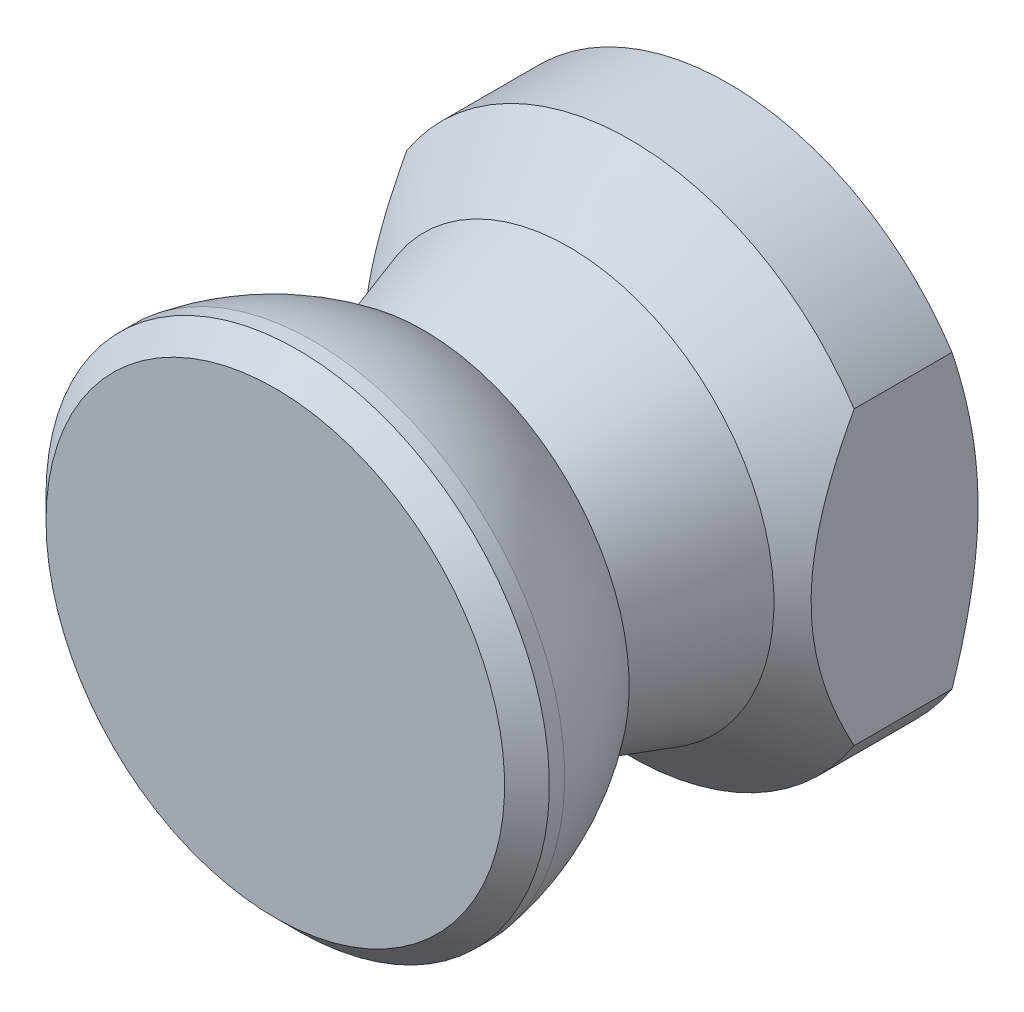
ISO-10303-21;
HEADER;
FILE_DESCRIPTION(('STEP AP214'),'2;1');
FILE_NAME('part.step','',(''),(''),'','','');
FILE_SCHEMA(('AUTOMOTIVE_DESIGN { 1 0 10303 214 1 1 1 1 }'));
ENDSEC;
DATA;
#1=APPLICATION_CONTEXT('core data for automotive mechanical design processes');
#2=APPLICATION_PROTOCOL_DEFINITION('international standard','automotive_design',2000,#1);
#3=PRODUCT_CONTEXT('',#1,'mechanical');
#4=PRODUCT('Part','Part','',(#3));
#5=PRODUCT_RELATED_PRODUCT_CATEGORY('part','',(#4));
#6=PRODUCT_DEFINITION_FORMATION('','',#4);
#7=PRODUCT_DEFINITION_CONTEXT('part definition',#1,'design');
#8=PRODUCT_DEFINITION('design','',#6,#7);
#9=PRODUCT_DEFINITION_SHAPE('','',#8);
#10=(LENGTH_UNIT() NAMED_UNIT(*) SI_UNIT(.MILLI.,.METRE.));
#11=(NAMED_UNIT(*) PLANE_ANGLE_UNIT() SI_UNIT($,.RADIAN.));
#12=(NAMED_UNIT(*) SI_UNIT($,.STERADIAN.) SOLID_ANGLE_UNIT());
#13=UNCERTAINTY_MEASURE_WITH_UNIT(LENGTH_MEASURE(1.E-05),#10,'distance_accuracy_value','');
#14=(GEOMETRIC_REPRESENTATION_CONTEXT(3) GLOBAL_UNCERTAINTY_ASSIGNED_CONTEXT((#13)) GLOBAL_UNIT_ASSIGNED_CONTEXT((#10,
#11,#12)) REPRESENTATION_CONTEXT('',''));
#15=CARTESIAN_POINT('',(0.,0.,0.));
#16=DIRECTION('',(0.,0.,1.));
#17=DIRECTION('',(1.,0.,0.));
#18=AXIS2_PLACEMENT_3D('',#15,#16,#17);
#19=CARTESIAN_POINT('',(0.,0.,-5.00000000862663));
#20=DIRECTION('',(0.,0.,-1.));
#21=DIRECTION('',(-1.,0.,0.));
#22=AXIS2_PLACEMENT_3D('',#19,#20,#21);
#23=CYLINDRICAL_SURFACE('',#22,9.55000017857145);
#24=CARTESIAN_POINT('',(0.,0.,5.3));
#25=DIRECTION('',(0.,0.,-1.));
#26=DIRECTION('',(-1.,0.,0.));
#27=AXIS2_PLACEMENT_3D('',#24,#25,#26);
#28=CIRCLE('',#27,9.55000017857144);
#29=CARTESIAN_POINT('',(8.,-5.21560192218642,5.3));
#30=VERTEX_POINT('',#29);
#31=CARTESIAN_POINT('',(-8.,-5.2156019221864,5.3));
#32=VERTEX_POINT('',#31);
#33=EDGE_CURVE('E73',#30,#32,#28,.T.);
#34=ORIENTED_EDGE('',*,*,#33,.T.);
#35=DIRECTION('',(0.,0.,-1.));
#36=VECTOR('',#35,1.);
#37=CARTESIAN_POINT('',(-8.,-5.2156019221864,-5.00000000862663));
#38=LINE('',#37,#36);
#39=CARTESIAN_POINT('',(-8.,-5.2156019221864,1.8));
#40=VERTEX_POINT('',#39);
#41=EDGE_CURVE('E35',#32,#40,#38,.T.);
#42=ORIENTED_EDGE('',*,*,#41,.T.);
#43=CARTESIAN_POINT('',(0.,0.,1.8));
#44=DIRECTION('',(0.,0.,-1.));
#45=DIRECTION('',(-1.,0.,0.));
#46=AXIS2_PLACEMENT_3D('',#43,#44,#45);
#47=CIRCLE('',#46,9.55000017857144);
#48=CARTESIAN_POINT('',(8.,-5.21560192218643,1.8));
#49=VERTEX_POINT('',#48);
#50=EDGE_CURVE('E81',#49,#40,#47,.T.);
#51=ORIENTED_EDGE('',*,*,#50,.F.);
#52=DIRECTION('',(0.,0.,-1.));
#53=VECTOR('',#52,1.);
#54=CARTESIAN_POINT('',(8.,-5.21560192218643,-5.00000000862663));
#55=LINE('',#54,#53);
#56=EDGE_CURVE('E129',#49,#30,#55,.F.);
#57=ORIENTED_EDGE('',*,*,#56,.T.);
#58=EDGE_LOOP('',(#34,#42,#51,#57));
#59=FACE_BOUND('',#58,.T.);
#60=ADVANCED_FACE('F14',(#59),#23,.T.);
#61=CARTESIAN_POINT('',(4.99999982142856,0.,0.));
#62=DIRECTION('',(0.,0.,1.));
#63=DIRECTION('',(1.,0.,0.));
#64=AXIS2_PLACEMENT_3D('',#61,#62,#63);
#65=PLANE('',#64);
#66=CARTESIAN_POINT('',(0.,0.,0.));
#67=DIRECTION('',(0.,0.,-1.));
#68=DIRECTION('',(-1.,0.,0.));
#69=AXIS2_PLACEMENT_3D('',#66,#67,#68);
#70=CIRCLE('',#69,5.);
#71=CARTESIAN_POINT('',(-5.,0.,0.));
#72=VERTEX_POINT('',#71);
#73=EDGE_CURVE('E304',#72,#72,#70,.T.);
#74=ORIENTED_EDGE('',*,*,#73,.F.);
#75=EDGE_LOOP('',(#74));
#76=FACE_BOUND('',#75,.T.);
#77=CARTESIAN_POINT('',(0.,0.,0.));
#78=DIRECTION('',(0.,0.,-1.));
#79=DIRECTION('',(-1.,0.,0.));
#80=AXIS2_PLACEMENT_3D('',#77,#78,#79);
#81=CIRCLE('',#80,6.54999939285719);
#82=CARTESIAN_POINT('',(-6.54999939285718,0.,0.));
#83=VERTEX_POINT('',#82);
#84=EDGE_CURVE('E84',#83,#83,#81,.T.);
#85=ORIENTED_EDGE('',*,*,#84,.T.);
#86=EDGE_LOOP('',(#85));
#87=FACE_BOUND('',#86,.T.);
#88=ADVANCED_FACE('F16',(#76,#87),#65,.F.);
#89=CARTESIAN_POINT('',(0.,0.,1.8));
#90=DIRECTION('',(0.,0.,1.));
#91=DIRECTION('',(1.,0.,0.));
#92=AXIS2_PLACEMENT_3D('',#89,#90,#91);
#93=CONICAL_SURFACE('',#92,9.55000017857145,1.0303769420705);
#94=ORIENTED_EDGE('',*,*,#84,.F.);
#95=EDGE_LOOP('',(#94));
#96=FACE_BOUND('',#95,.T.);
#97=ORIENTED_EDGE('',*,*,#50,.T.);
#98=CARTESIAN_POINT('',(-8.,-15.1902545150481,6.37086174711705));
#99=CARTESIAN_POINT('',(-8.00000000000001,-14.8124699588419,6.17033892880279));
#100=CARTESIAN_POINT('',(-8.00000000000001,-14.4340344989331,5.97102929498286));
#101=CARTESIAN_POINT('',(-8.00000000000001,-13.6755227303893,5.57548779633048));
#102=CARTESIAN_POINT('',(-8.00000000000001,-13.2954462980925,5.37925616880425));
#103=CARTESIAN_POINT('',(-8.00000000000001,-12.532290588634,4.99000177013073));
#104=CARTESIAN_POINT('',(-8.00000000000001,-12.1492058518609,4.79698967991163));
#105=CARTESIAN_POINT('',(-8.00000000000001,-11.3807020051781,4.41568748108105));
#106=CARTESIAN_POINT('',(-8.00000000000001,-10.995282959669,4.22739724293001));
#107=CARTESIAN_POINT('',(-8.00000000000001,-10.1994441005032,3.84614640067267));
#108=CARTESIAN_POINT('',(-8.00000000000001,-9.78885616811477,3.65353549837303));
#109=CARTESIAN_POINT('',(-8.00000000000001,-8.96370298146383,3.27690123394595));
#110=CARTESIAN_POINT('',(-8.00000000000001,-8.54913741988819,3.0928785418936));
#111=CARTESIAN_POINT('',(-8.00000000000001,-7.71556883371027,2.73633689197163));
#112=CARTESIAN_POINT('',(-8.00000000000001,-7.29657088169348,2.5638061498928));
#113=CARTESIAN_POINT('',(-8.00000000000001,-6.4527136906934,2.23381622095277));
#114=CARTESIAN_POINT('',(-8.,-6.02785561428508,2.07635409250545));
#115=CARTESIAN_POINT('',(-8.,-5.17588427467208,1.78322575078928));
#116=CARTESIAN_POINT('',(-8.00000000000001,-4.74884844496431,1.64733691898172));
#117=CARTESIAN_POINT('',(-8.00000000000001,-3.88710371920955,1.40177301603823));
#118=CARTESIAN_POINT('',(-8.00000000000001,-3.45239506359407,1.29209712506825));
#119=CARTESIAN_POINT('',(-8.00000000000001,-2.79923220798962,1.15392516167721));
#120=CARTESIAN_POINT('',(-8.00000000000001,-2.58348198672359,1.11254409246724));
#121=CARTESIAN_POINT('',(-8.00000000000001,-2.15045179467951,1.03883192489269));
#122=CARTESIAN_POINT('',(-8.00000000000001,-1.93317202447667,1.00649966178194));
#123=CARTESIAN_POINT('',(-8.00000000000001,-1.49739529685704,0.951685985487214));
#124=CARTESIAN_POINT('',(-8.00000000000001,-1.27889851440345,0.929203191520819));
#125=CARTESIAN_POINT('',(-8.00000000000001,-0.841070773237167,0.894697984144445));
#126=CARTESIAN_POINT('',(-8.,-0.621739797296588,0.882675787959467));
#127=CARTESIAN_POINT('',(-8.,-0.154919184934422,0.868613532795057));
#128=CARTESIAN_POINT('',(-8.,0.0926161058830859,0.868031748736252));
#129=CARTESIAN_POINT('',(-8.00000000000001,0.587336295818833,0.880633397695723));
#130=CARTESIAN_POINT('',(-8.00000000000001,0.8345211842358,0.893817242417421));
#131=CARTESIAN_POINT('',(-8.00000000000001,1.32786695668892,0.933459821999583));
#132=CARTESIAN_POINT('',(-8.00000000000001,1.57402760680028,0.95992143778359));
#133=CARTESIAN_POINT('',(-8.00000000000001,2.06469203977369,1.02520452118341));
#134=CARTESIAN_POINT('',(-8.00000000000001,2.30919578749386,1.06402625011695));
#135=CARTESIAN_POINT('',(-8.00000000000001,2.80258651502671,1.1540144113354));
#136=CARTESIAN_POINT('',(-8.00000000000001,3.05141845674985,1.20548010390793));
#137=CARTESIAN_POINT('',(-8.00000000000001,3.54669810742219,1.31877011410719));
#138=CARTESIAN_POINT('',(-8.,3.79314576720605,1.38059464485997));
#139=CARTESIAN_POINT('',(-8.,4.28365885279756,1.51321945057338));
#140=CARTESIAN_POINT('',(-8.,4.52772371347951,1.5840218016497));
#141=CARTESIAN_POINT('',(-8.,5.01346768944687,1.73329258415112));
#142=CARTESIAN_POINT('',(-8.,5.25514695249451,1.81176053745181));
#143=CARTESIAN_POINT('',(-8.,5.7326430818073,1.97398295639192));
#144=CARTESIAN_POINT('',(-8.,5.9684933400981,2.05763957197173));
#145=CARTESIAN_POINT('',(-8.00000000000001,6.43821668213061,2.23034436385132));
#146=CARTESIAN_POINT('',(-8.,6.6720896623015,2.31939282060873));
#147=CARTESIAN_POINT('',(-8.,7.3711292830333,2.59342803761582));
#148=CARTESIAN_POINT('',(-8.,7.83361053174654,2.78526778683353));
#149=CARTESIAN_POINT('',(-8.,8.75326859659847,3.1824152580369));
#150=CARTESIAN_POINT('',(-8.,9.21043924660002,3.38773708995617));
#151=CARTESIAN_POINT('',(-8.,10.1201514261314,3.80821821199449));
#152=CARTESIAN_POINT('',(-8.,10.5726934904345,4.02337634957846));
#153=CARTESIAN_POINT('',(-8.,11.4759221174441,4.4619860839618));
#154=CARTESIAN_POINT('',(-8.,11.9265944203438,4.68546692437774));
#155=CARTESIAN_POINT('',(-8.,12.8250434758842,5.13818719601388));
#156=CARTESIAN_POINT('',(-8.,13.2728201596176,5.36742676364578));
#157=CARTESIAN_POINT('',(-8.,14.1657728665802,5.8302597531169));
#158=CARTESIAN_POINT('',(-8.,14.6109502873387,6.06385048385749));
#159=CARTESIAN_POINT('',(-8.,15.4994087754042,6.5345960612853));
#160=CARTESIAN_POINT('',(-8.,15.9426898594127,6.77175087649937));
#161=CARTESIAN_POINT('',(-8.,17.1508238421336,7.42312416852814));
#162=CARTESIAN_POINT('',(-8.,17.9141413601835,7.84018901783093));
#163=CARTESIAN_POINT('',(-8.,19.4375703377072,8.6804171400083));
#164=CARTESIAN_POINT('',(-8.,20.1976812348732,9.10358142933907));
#165=CARTESIAN_POINT('',(-8.,21.7095128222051,9.951032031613));
#166=CARTESIAN_POINT('',(-7.99999999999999,22.4612527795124,10.3752840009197));
#167=CARTESIAN_POINT('',(-7.99999999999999,23.5873854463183,11.0140921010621));
#168=CARTESIAN_POINT('',(-7.99999999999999,23.962480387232,11.2274122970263));
#169=CARTESIAN_POINT('',(-7.99999999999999,24.7122545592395,11.6547804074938));
#170=CARTESIAN_POINT('',(-8.,25.0869337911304,11.8688283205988));
#171=CARTESIAN_POINT('',(-8.,25.4614319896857,12.0831925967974));
#172=B_SPLINE_CURVE_WITH_KNOTS('',3,(#98,#99,#100,#101,#102,#103,#104,#105,#106,#107,#108,#109,
#110,#111,#112,#113,#114,#115,#116,#117,#118,#119,#120,#121,#122,#123,#124,#125,#126,#127,#128,
#129,#130,#131,#132,#133,#134,#135,#136,#137,#138,#139,#140,#141,#142,#143,#144,#145,#146,#147,
#148,#149,#150,#151,#152,#153,#154,#155,#156,#157,#158,#159,#160,#161,#162,#163,#164,#165,#166,
#167,#168,#169,#170,#171),.UNSPECIFIED.,.F.,.F.,(4,2,2,2,2,2,2,2,2,2,2,2,2,2,2,2,2,2,2,2,2,2,2,
2,2,2,2,2,2,2,2,2,2,2,2,2,4),(0.,1.28311846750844,2.56633537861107,3.853192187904,
5.14001365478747,6.50050163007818,7.86109557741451,9.22027213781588,10.5791828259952,
11.9230033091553,13.266781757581,13.9256710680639,14.5844755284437,15.2431876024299,
15.9019133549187,16.6441273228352,17.3863634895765,18.1287607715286,18.8711737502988,
19.6332165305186,20.395274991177,21.1575099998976,21.9196974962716,22.6703627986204,
23.4210671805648,24.9228125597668,26.4261554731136,27.9293226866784,29.4383912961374,
30.9474956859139,32.4556958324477,33.9638826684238,36.5733159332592,39.183189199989,
41.7727573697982,43.0672897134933,44.3618195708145),.UNSPECIFIED.);
#173=CARTESIAN_POINT('',(-8.,5.21560192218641,1.8));
#174=VERTEX_POINT('',#173);
#175=EDGE_CURVE('E123',#40,#174,#172,.T.);
#176=ORIENTED_EDGE('',*,*,#175,.T.);
#177=CARTESIAN_POINT('',(8.,5.21560192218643,1.8));
#178=VERTEX_POINT('',#177);
#179=EDGE_CURVE('E67',#174,#178,#47,.T.);
#180=ORIENTED_EDGE('',*,*,#179,.T.);
#181=CARTESIAN_POINT('',(8.,-15.1902545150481,6.37086174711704));
#182=CARTESIAN_POINT('',(7.99999999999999,-14.8124699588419,6.17033892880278));
#183=CARTESIAN_POINT('',(7.99999999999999,-14.4340344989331,5.97102929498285));
#184=CARTESIAN_POINT('',(7.99999999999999,-13.6755227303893,5.57548779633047));
#185=CARTESIAN_POINT('',(7.99999999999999,-13.2954462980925,5.37925616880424));
#186=CARTESIAN_POINT('',(7.99999999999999,-12.532290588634,4.99000177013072));
#187=CARTESIAN_POINT('',(7.99999999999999,-12.1492058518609,4.79698967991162));
#188=CARTESIAN_POINT('',(7.99999999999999,-11.3807020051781,4.41568748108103));
#189=CARTESIAN_POINT('',(7.99999999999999,-10.995282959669,4.22739724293));
#190=CARTESIAN_POINT('',(7.99999999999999,-10.1994441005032,3.84614640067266));
#191=CARTESIAN_POINT('',(7.99999999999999,-9.78885616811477,3.65353549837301));
#192=CARTESIAN_POINT('',(7.99999999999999,-8.96370298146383,3.27690123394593));
#193=CARTESIAN_POINT('',(7.99999999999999,-8.54913741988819,3.09287854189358));
#194=CARTESIAN_POINT('',(7.99999999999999,-7.71556883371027,2.73633689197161));
#195=CARTESIAN_POINT('',(7.99999999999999,-7.29657088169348,2.56380614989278));
#196=CARTESIAN_POINT('',(7.99999999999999,-6.4527136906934,2.23381622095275));
#197=CARTESIAN_POINT('',(8.,-6.02785561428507,2.07635409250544));
#198=CARTESIAN_POINT('',(8.,-5.17588427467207,1.78322575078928));
#199=CARTESIAN_POINT('',(7.99999999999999,-4.74884844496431,1.6473369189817));
#200=CARTESIAN_POINT('',(7.99999999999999,-3.88710371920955,1.40177301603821));
#201=CARTESIAN_POINT('',(7.99999999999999,-3.45239506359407,1.29209712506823));
#202=CARTESIAN_POINT('',(7.99999999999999,-2.79923220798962,1.15392516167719));
#203=CARTESIAN_POINT('',(7.99999999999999,-2.58348198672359,1.11254409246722));
#204=CARTESIAN_POINT('',(7.99999999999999,-2.15045179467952,1.03883192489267));
#205=CARTESIAN_POINT('',(7.99999999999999,-1.93317202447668,1.00649966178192));
#206=CARTESIAN_POINT('',(7.99999999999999,-1.49739529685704,0.951685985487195));
#207=CARTESIAN_POINT('',(7.99999999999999,-1.27889851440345,0.929203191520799));
#208=CARTESIAN_POINT('',(7.99999999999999,-0.841070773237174,0.894697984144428));
#209=CARTESIAN_POINT('',(8.,-0.621739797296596,0.882675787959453));
#210=CARTESIAN_POINT('',(8.,-0.15491918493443,0.868613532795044));
#211=CARTESIAN_POINT('',(8.,0.092616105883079,0.868031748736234));
#212=CARTESIAN_POINT('',(7.99999999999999,0.587336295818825,0.880633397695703));
#213=CARTESIAN_POINT('',(7.99999999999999,0.83452118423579,0.893817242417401));
#214=CARTESIAN_POINT('',(7.99999999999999,1.32786695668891,0.933459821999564));
#215=CARTESIAN_POINT('',(7.99999999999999,1.57402760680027,0.95992143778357));
#216=CARTESIAN_POINT('',(7.99999999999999,2.06469203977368,1.02520452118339));
#217=CARTESIAN_POINT('',(7.99999999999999,2.30919578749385,1.06402625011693));
#218=CARTESIAN_POINT('',(7.99999999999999,2.8025865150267,1.15401441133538));
#219=CARTESIAN_POINT('',(7.99999999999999,3.05141845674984,1.20548010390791));
#220=CARTESIAN_POINT('',(7.99999999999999,3.54669810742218,1.31877011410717));
#221=CARTESIAN_POINT('',(8.,3.79314576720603,1.38059464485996));
#222=CARTESIAN_POINT('',(8.,4.28365885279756,1.51321945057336));
#223=CARTESIAN_POINT('',(8.,4.5277237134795,1.58402180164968));
#224=CARTESIAN_POINT('',(8.,5.01346768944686,1.7332925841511));
#225=CARTESIAN_POINT('',(8.,5.2551469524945,1.8117605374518));
#226=CARTESIAN_POINT('',(8.,5.73264308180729,1.97398295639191));
#227=CARTESIAN_POINT('',(8.,5.9684933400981,2.05763957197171));
#228=CARTESIAN_POINT('',(7.99999999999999,6.4382166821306,2.2303443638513));
#229=CARTESIAN_POINT('',(8.,6.67208966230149,2.31939282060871));
#230=CARTESIAN_POINT('',(8.,7.37112928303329,2.5934280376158));
#231=CARTESIAN_POINT('',(8.,7.83361053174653,2.78526778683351));
#232=CARTESIAN_POINT('',(8.,8.75326859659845,3.18241525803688));
#233=CARTESIAN_POINT('',(8.,9.2104392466,3.38773708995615));
#234=CARTESIAN_POINT('',(8.,10.1201514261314,3.80821821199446));
#235=CARTESIAN_POINT('',(8.,10.5726934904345,4.02337634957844));
#236=CARTESIAN_POINT('',(8.,11.475922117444,4.46198608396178));
#237=CARTESIAN_POINT('',(8.,11.9265944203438,4.68546692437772));
#238=CARTESIAN_POINT('',(8.,12.8250434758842,5.13818719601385));
#239=CARTESIAN_POINT('',(8.,13.2728201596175,5.36742676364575));
#240=CARTESIAN_POINT('',(8.,14.1657728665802,5.83025975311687));
#241=CARTESIAN_POINT('',(8.,14.6109502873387,6.06385048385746));
#242=CARTESIAN_POINT('',(8.,15.4994087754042,6.53459606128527));
#243=CARTESIAN_POINT('',(8.,15.9426898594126,6.77175087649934));
#244=CARTESIAN_POINT('',(8.,17.1508238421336,7.42312416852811));
#245=CARTESIAN_POINT('',(8.,17.9141413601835,7.8401890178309));
#246=CARTESIAN_POINT('',(8.,19.4375703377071,8.68041714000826));
#247=CARTESIAN_POINT('',(8.,20.1976812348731,9.10358142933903));
#248=CARTESIAN_POINT('',(8.,21.709512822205,9.95103203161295));
#249=CARTESIAN_POINT('',(8.00000000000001,22.4612527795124,10.3752840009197));
#250=CARTESIAN_POINT('',(8.00000000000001,23.5873854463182,11.0140921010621));
#251=CARTESIAN_POINT('',(8.00000000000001,23.9624803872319,11.2274122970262));
#252=CARTESIAN_POINT('',(8.00000000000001,24.7122545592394,11.6547804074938));
#253=CARTESIAN_POINT('',(8.,25.0869337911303,11.8688283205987));
#254=CARTESIAN_POINT('',(8.,25.4614319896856,12.0831925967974));
#255=B_SPLINE_CURVE_WITH_KNOTS('',3,(#181,#182,#183,#184,#185,#186,#187,#188,#189,#190,#191,
#192,#193,#194,#195,#196,#197,#198,#199,#200,#201,#202,#203,#204,#205,#206,#207,#208,#209,#210,
#211,#212,#213,#214,#215,#216,#217,#218,#219,#220,#221,#222,#223,#224,#225,#226,#227,#228,#229,
#230,#231,#232,#233,#234,#235,#236,#237,#238,#239,#240,#241,#242,#243,#244,#245,#246,#247,#248,
#249,#250,#251,#252,#253,#254),.UNSPECIFIED.,.F.,.F.,(4,2,2,2,2,2,2,2,2,2,2,2,2,2,2,2,2,2,2,2,2,
2,2,2,2,2,2,2,2,2,2,2,2,2,2,2,4),(0.,1.28311846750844,2.56633537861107,3.853192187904,
5.14001365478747,6.50050163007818,7.86109557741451,9.22027213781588,10.5791828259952,
11.9230033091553,13.266781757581,13.9256710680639,14.5844755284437,15.2431876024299,
15.9019133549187,16.6441273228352,17.3863634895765,18.1287607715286,18.8711737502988,
19.6332165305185,20.395274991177,21.1575099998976,21.9196974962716,22.6703627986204,
23.4210671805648,24.9228125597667,26.4261554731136,27.9293226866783,29.4383912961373,
30.9474956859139,32.4556958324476,33.9638826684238,36.5733159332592,39.1831891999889,
41.7727573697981,43.0672897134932,44.3618195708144),.UNSPECIFIED.);
#256=EDGE_CURVE('E105',#178,#49,#255,.F.);
#257=ORIENTED_EDGE('',*,*,#256,.T.);
#258=EDGE_LOOP('',(#97,#176,#180,#257));
#259=FACE_BOUND('',#258,.T.);
#260=ADVANCED_FACE('F117',(#96,#259),#93,.T.);
#261=ORIENTED_EDGE('',*,*,#179,.F.);
#262=DIRECTION('',(0.,0.,-1.));
#263=VECTOR('',#262,1.);
#264=CARTESIAN_POINT('',(-8.,5.21560192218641,-5.00000000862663));
#265=LINE('',#264,#263);
#266=CARTESIAN_POINT('',(-8.,5.21560192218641,5.3));
#267=VERTEX_POINT('',#266);
#268=EDGE_CURVE('E60',#174,#267,#265,.F.);
#269=ORIENTED_EDGE('',*,*,#268,.T.);
#270=CARTESIAN_POINT('',(8.,5.21560192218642,5.3));
#271=VERTEX_POINT('',#270);
#272=EDGE_CURVE('E42',#267,#271,#28,.T.);
#273=ORIENTED_EDGE('',*,*,#272,.T.);
#274=DIRECTION('',(0.,0.,-1.));
#275=VECTOR('',#274,1.);
#276=CARTESIAN_POINT('',(8.,5.21560192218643,-5.00000000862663));
#277=LINE('',#276,#275);
#278=EDGE_CURVE('E114',#271,#178,#277,.T.);
#279=ORIENTED_EDGE('',*,*,#278,.T.);
#280=EDGE_LOOP('',(#261,#269,#273,#279));
#281=FACE_BOUND('',#280,.T.);
#282=ADVANCED_FACE('F66',(#281),#23,.T.);
#283=CARTESIAN_POINT('',(0.,0.,7.5));
#284=DIRECTION('',(0.,0.,-1.));
#285=DIRECTION('',(-1.,0.,0.));
#286=AXIS2_PLACEMENT_3D('',#283,#284,#285);
#287=CONICAL_SURFACE('',#286,7.33333255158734,0.789171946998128);
#288=ORIENTED_EDGE('',*,*,#272,.F.);
#289=CARTESIAN_POINT('',(-8.,-15.4488450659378,-2.48831605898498));
#290=CARTESIAN_POINT('',(-8.00000000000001,-15.0899894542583,-2.17209857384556));
#291=CARTESIAN_POINT('',(-8.00000000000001,-14.7300201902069,-1.85713243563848));
#292=CARTESIAN_POINT('',(-8.00000000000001,-14.0072620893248,-1.23037340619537));
#293=CARTESIAN_POINT('',(-8.00000000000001,-13.6444729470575,-0.918580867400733));
#294=CARTESIAN_POINT('',(-8.00000000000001,-12.9139219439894,-0.297515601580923));
#295=CARTESIAN_POINT('',(-8.00000000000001,-12.5461450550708,0.0117394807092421));
#296=CARTESIAN_POINT('',(-8.00000000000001,-11.8064839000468,0.625270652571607));
#297=CARTESIAN_POINT('',(-8.00000000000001,-11.434599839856,0.929546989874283));
#298=CARTESIAN_POINT('',(-8.00000000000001,-10.6627861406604,1.55021656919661));
#299=CARTESIAN_POINT('',(-8.00000000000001,-10.2625341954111,1.86620997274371));
#300=CARTESIAN_POINT('',(-8.00000000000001,-9.45466056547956,2.48882569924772));
#301=CARTESIAN_POINT('',(-8.00000000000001,-9.04703777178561,2.79544659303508));
#302=CARTESIAN_POINT('',(-8.00000000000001,-8.42894451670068,3.24542493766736));
#303=CARTESIAN_POINT('',(-8.00000000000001,-8.22199878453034,3.39362590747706));
#304=CARTESIAN_POINT('',(-8.00000000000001,-7.80543599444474,3.68621920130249));
#305=CARTESIAN_POINT('',(-8.00000000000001,-7.59581902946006,3.83061165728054));
#306=CARTESIAN_POINT('',(-8.00000000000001,-7.17359925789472,4.11484238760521));
#307=CARTESIAN_POINT('',(-8.00000000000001,-6.96099730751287,4.25468193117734));
#308=CARTESIAN_POINT('',(-8.00000000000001,-6.53234254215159,4.52895246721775));
#309=CARTESIAN_POINT('',(-8.,-6.31628999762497,4.66338388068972));
#310=CARTESIAN_POINT('',(-8.,-5.9471196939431,4.88550309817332));
#311=CARTESIAN_POINT('',(-8.00000000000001,-5.79502099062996,4.97488281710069));
#312=CARTESIAN_POINT('',(-8.00000000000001,-5.48877440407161,5.1500538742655));
#313=CARTESIAN_POINT('',(-8.00000000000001,-5.33462651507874,5.23584520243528));
#314=CARTESIAN_POINT('',(-8.00000000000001,-4.86875101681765,5.48713918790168));
#315=CARTESIAN_POINT('',(-8.00000000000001,-4.55366078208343,5.64651966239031));
#316=CARTESIAN_POINT('',(-8.00000000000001,-3.91623804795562,5.94242015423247));
#317=CARTESIAN_POINT('',(-8.00000000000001,-3.59399538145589,6.07913165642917));
#318=CARTESIAN_POINT('',(-8.,-2.93906332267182,6.32481593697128));
#319=CARTESIAN_POINT('',(-8.,-2.60638044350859,6.43380563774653));
#320=CARTESIAN_POINT('',(-8.,-2.03449828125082,6.58867209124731));
#321=CARTESIAN_POINT('',(-8.,-1.79777047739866,6.64365840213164));
#322=CARTESIAN_POINT('',(-8.00000000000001,-1.32061187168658,6.73424365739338));
#323=CARTESIAN_POINT('',(-8.00000000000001,-1.08018173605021,6.76984604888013));
#324=CARTESIAN_POINT('',(-8.00000000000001,-0.597857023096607,6.81975102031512));
#325=CARTESIAN_POINT('',(-8.00000000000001,-0.355969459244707,6.83412044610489));
#326=CARTESIAN_POINT('',(-8.,0.128127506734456,6.84096033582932));
#327=CARTESIAN_POINT('',(-8.,0.370336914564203,6.83343040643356));
#328=CARTESIAN_POINT('',(-8.,0.851674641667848,6.79701262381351));
#329=CARTESIAN_POINT('',(-8.,1.09081270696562,6.76825094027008));
#330=CARTESIAN_POINT('',(-8.00000000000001,1.56591929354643,6.69101725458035));
#331=CARTESIAN_POINT('',(-8.,1.80188702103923,6.64254040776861));
#332=CARTESIAN_POINT('',(-8.,2.15385758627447,6.55640349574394));
#333=CARTESIAN_POINT('',(-8.,2.27150213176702,6.52524193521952));
#334=CARTESIAN_POINT('',(-8.,2.50557877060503,6.4587775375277));
#335=CARTESIAN_POINT('',(-8.,2.62201122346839,6.42347596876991));
#336=CARTESIAN_POINT('',(-8.,2.96942225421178,6.31183277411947));
#337=CARTESIAN_POINT('',(-8.,3.19856200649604,6.22974079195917));
#338=CARTESIAN_POINT('',(-8.,3.74203457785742,6.01745516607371));
#339=CARTESIAN_POINT('',(-8.,4.05395206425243,5.88112528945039));
#340=CARTESIAN_POINT('',(-8.00000000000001,4.66866949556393,5.5891064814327));
#341=CARTESIAN_POINT('',(-8.,4.97146393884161,5.43340614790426));
#342=CARTESIAN_POINT('',(-8.,5.57003653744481,5.10658871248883));
#343=CARTESIAN_POINT('',(-8.,5.86578377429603,4.93541545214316));
#344=CARTESIAN_POINT('',(-8.,6.45020882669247,4.58161160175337));
#345=CARTESIAN_POINT('',(-8.,6.73888811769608,4.39898343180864));
#346=CARTESIAN_POINT('',(-8.,7.29548035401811,4.03449479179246));
#347=CARTESIAN_POINT('',(-8.,7.56369236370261,3.85308861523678));
#348=CARTESIAN_POINT('',(-8.,8.095643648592,3.48380651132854));
#349=CARTESIAN_POINT('',(-8.,8.35938255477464,3.29593005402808));
#350=CARTESIAN_POINT('',(-8.,8.88067558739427,2.91668914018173));
#351=CARTESIAN_POINT('',(-8.,9.13826412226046,2.72537181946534));
#352=CARTESIAN_POINT('',(-8.,9.65016867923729,2.3385401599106));
#353=CARTESIAN_POINT('',(-8.,9.90448553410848,2.14302692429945));
#354=CARTESIAN_POINT('',(-8.,10.1574667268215,1.94582850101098));
#355=B_SPLINE_CURVE_WITH_KNOTS('',3,(#289,#290,#291,#292,#293,#294,#295,#296,#297,#298,#299,
#300,#301,#302,#303,#304,#305,#306,#307,#308,#309,#310,#311,#312,#313,#314,#315,#316,#317,#318,
#319,#320,#321,#322,#323,#324,#325,#326,#327,#328,#329,#330,#331,#332,#333,#334,#335,#336,#337,
#338,#339,#340,#341,#342,#343,#344,#345,#346,#347,#348,#349,#350,#351,#352,#353,#354),
.UNSPECIFIED.,.F.,.F.,(4,2,2,2,2,2,2,2,2,2,2,2,2,2,2,2,2,2,2,2,2,2,2,2,2,2,2,2,2,2,2,2,4),(0.,
1.43490927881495,2.86997620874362,4.31149872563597,5.7529492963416,7.28271662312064,
8.81271606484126,9.57629935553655,10.3398561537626,11.103198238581,11.8664807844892,
12.3956843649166,12.9248894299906,13.9835424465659,15.0327390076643,16.0812935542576,
16.8096929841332,17.5379628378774,18.2639350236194,18.989920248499,19.7116256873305,
20.4335085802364,20.7985497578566,21.1634793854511,21.8931920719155,22.9135218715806,
23.934455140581,24.9592552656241,25.9838396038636,26.9551237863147,27.9264877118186,
28.8890351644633,29.8513325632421),.UNSPECIFIED.);
#356=EDGE_CURVE('E9',#267,#32,#355,.F.);
#357=ORIENTED_EDGE('',*,*,#356,.T.);
#358=ORIENTED_EDGE('',*,*,#33,.F.);
#359=CARTESIAN_POINT('',(8.,-15.4488450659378,-2.48831605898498));
#360=CARTESIAN_POINT('',(7.99999999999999,-15.0899894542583,-2.17209857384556));
#361=CARTESIAN_POINT('',(7.99999999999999,-14.7300201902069,-1.85713243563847));
#362=CARTESIAN_POINT('',(7.99999999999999,-14.0072620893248,-1.23037340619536));
#363=CARTESIAN_POINT('',(7.99999999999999,-13.6444729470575,-0.918580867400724));
#364=CARTESIAN_POINT('',(7.99999999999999,-12.9139219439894,-0.297515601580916));
#365=CARTESIAN_POINT('',(7.99999999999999,-12.5461450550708,0.0117394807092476));
#366=CARTESIAN_POINT('',(7.99999999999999,-11.8064839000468,0.625270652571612));
#367=CARTESIAN_POINT('',(7.99999999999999,-11.434599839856,0.929546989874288));
#368=CARTESIAN_POINT('',(7.99999999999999,-10.6627861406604,1.55021656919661));
#369=CARTESIAN_POINT('',(7.99999999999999,-10.2625341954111,1.86620997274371));
#370=CARTESIAN_POINT('',(7.99999999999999,-9.45466056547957,2.48882569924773));
#371=CARTESIAN_POINT('',(7.99999999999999,-9.04703777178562,2.79544659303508));
#372=CARTESIAN_POINT('',(7.99999999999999,-8.42894451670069,3.24542493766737));
#373=CARTESIAN_POINT('',(7.99999999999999,-8.22199878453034,3.39362590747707));
#374=CARTESIAN_POINT('',(7.99999999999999,-7.80543599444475,3.6862192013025));
#375=CARTESIAN_POINT('',(7.99999999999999,-7.59581902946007,3.83061165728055));
#376=CARTESIAN_POINT('',(7.99999999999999,-7.17359925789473,4.11484238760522));
#377=CARTESIAN_POINT('',(7.99999999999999,-6.96099730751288,4.25468193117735));
#378=CARTESIAN_POINT('',(7.99999999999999,-6.5323425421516,4.52895246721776));
#379=CARTESIAN_POINT('',(8.,-6.31628999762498,4.66338388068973));
#380=CARTESIAN_POINT('',(8.,-5.94711969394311,4.88550309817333));
#381=CARTESIAN_POINT('',(7.99999999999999,-5.79502099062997,4.9748828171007));
#382=CARTESIAN_POINT('',(7.99999999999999,-5.48877440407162,5.15005387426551));
#383=CARTESIAN_POINT('',(7.99999999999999,-5.33462651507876,5.23584520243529));
#384=CARTESIAN_POINT('',(7.99999999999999,-4.86875101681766,5.48713918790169));
#385=CARTESIAN_POINT('',(7.99999999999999,-4.55366078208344,5.64651966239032));
#386=CARTESIAN_POINT('',(7.99999999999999,-3.91623804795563,5.94242015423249));
#387=CARTESIAN_POINT('',(7.99999999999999,-3.59399538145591,6.07913165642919));
#388=CARTESIAN_POINT('',(8.,-2.93906332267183,6.32481593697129));
#389=CARTESIAN_POINT('',(8.,-2.6063804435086,6.43380563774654));
#390=CARTESIAN_POINT('',(8.,-2.03449828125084,6.58867209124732));
#391=CARTESIAN_POINT('',(8.,-1.79777047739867,6.64365840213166));
#392=CARTESIAN_POINT('',(7.99999999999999,-1.32061187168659,6.7342436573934));
#393=CARTESIAN_POINT('',(7.99999999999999,-1.08018173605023,6.76984604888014));
#394=CARTESIAN_POINT('',(7.99999999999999,-0.59785702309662,6.81975102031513));
#395=CARTESIAN_POINT('',(7.99999999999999,-0.35596945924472,6.83412044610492));
#396=CARTESIAN_POINT('',(8.,0.128127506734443,6.84096033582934));
#397=CARTESIAN_POINT('',(8.,0.37033691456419,6.83343040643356));
#398=CARTESIAN_POINT('',(8.,0.851674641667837,6.79701262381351));
#399=CARTESIAN_POINT('',(8.,1.09081270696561,6.7682509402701));
#400=CARTESIAN_POINT('',(7.99999999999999,1.56591929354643,6.69101725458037));
#401=CARTESIAN_POINT('',(8.,1.80188702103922,6.64254040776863));
#402=CARTESIAN_POINT('',(8.,2.15385758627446,6.55640349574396));
#403=CARTESIAN_POINT('',(8.,2.27150213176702,6.52524193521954));
#404=CARTESIAN_POINT('',(8.,2.50557877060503,6.45877753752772));
#405=CARTESIAN_POINT('',(8.,2.62201122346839,6.42347596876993));
#406=CARTESIAN_POINT('',(8.,2.96942225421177,6.31183277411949));
#407=CARTESIAN_POINT('',(8.,3.19856200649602,6.22974079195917));
#408=CARTESIAN_POINT('',(8.,3.74203457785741,6.01745516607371));
#409=CARTESIAN_POINT('',(8.,4.05395206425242,5.8811252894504));
#410=CARTESIAN_POINT('',(7.99999999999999,4.66866949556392,5.58910648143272));
#411=CARTESIAN_POINT('',(8.,4.9714639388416,5.43340614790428));
#412=CARTESIAN_POINT('',(8.,5.57003653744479,5.10658871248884));
#413=CARTESIAN_POINT('',(8.,5.86578377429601,4.93541545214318));
#414=CARTESIAN_POINT('',(8.,6.45020882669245,4.58161160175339));
#415=CARTESIAN_POINT('',(8.,6.73888811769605,4.39898343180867));
#416=CARTESIAN_POINT('',(8.,7.29548035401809,4.03449479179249));
#417=CARTESIAN_POINT('',(8.,7.56369236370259,3.85308861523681));
#418=CARTESIAN_POINT('',(8.,8.09564364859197,3.48380651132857));
#419=CARTESIAN_POINT('',(8.,8.3593825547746,3.29593005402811));
#420=CARTESIAN_POINT('',(8.,8.88067558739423,2.91668914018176));
#421=CARTESIAN_POINT('',(8.,9.13826412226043,2.72537181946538));
#422=CARTESIAN_POINT('',(8.,9.65016867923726,2.33854015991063));
#423=CARTESIAN_POINT('',(8.,9.90448553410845,2.14302692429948));
#424=CARTESIAN_POINT('',(8.,10.1574667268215,1.94582850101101));
#425=B_SPLINE_CURVE_WITH_KNOTS('',3,(#359,#360,#361,#362,#363,#364,#365,#366,#367,#368,#369,
#370,#371,#372,#373,#374,#375,#376,#377,#378,#379,#380,#381,#382,#383,#384,#385,#386,#387,#388,
#389,#390,#391,#392,#393,#394,#395,#396,#397,#398,#399,#400,#401,#402,#403,#404,#405,#406,#407,
#408,#409,#410,#411,#412,#413,#414,#415,#416,#417,#418,#419,#420,#421,#422,#423,#424),
.UNSPECIFIED.,.F.,.F.,(4,2,2,2,2,2,2,2,2,2,2,2,2,2,2,2,2,2,2,2,2,2,2,2,2,2,2,2,2,2,2,2,4),(0.,
1.43490927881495,2.86997620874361,4.31149872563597,5.7529492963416,7.28271662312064,
8.81271606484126,9.57629935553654,10.3398561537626,11.103198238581,11.8664807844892,
12.3956843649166,12.9248894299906,13.9835424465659,15.0327390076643,16.0812935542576,
16.8096929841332,17.5379628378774,18.2639350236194,18.989920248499,19.7116256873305,
20.4335085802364,20.7985497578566,21.1634793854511,21.8931920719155,22.9135218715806,
23.934455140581,24.9592552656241,25.9838396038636,26.9551237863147,27.9264877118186,
28.8890351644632,29.851332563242),.UNSPECIFIED.);
#426=EDGE_CURVE('E28',#30,#271,#425,.T.);
#427=ORIENTED_EDGE('',*,*,#426,.T.);
#428=EDGE_LOOP('',(#288,#357,#358,#427));
#429=FACE_BOUND('',#428,.T.);
#430=CARTESIAN_POINT('',(0.,0.,7.5));
#431=DIRECTION('',(0.,0.,-1.));
#432=DIRECTION('',(-1.,0.,0.));
#433=AXIS2_PLACEMENT_3D('',#430,#431,#432);
#434=CIRCLE('',#433,7.33333255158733);
#435=CARTESIAN_POINT('',(-7.33333255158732,0.,7.5));
#436=VERTEX_POINT('',#435);
#437=EDGE_CURVE('E74',#436,#436,#434,.T.);
#438=ORIENTED_EDGE('',*,*,#437,.T.);
#439=EDGE_LOOP('',(#438));
#440=FACE_BOUND('',#439,.T.);
#441=ADVANCED_FACE('F71',(#429,#440),#287,.T.);
#442=CARTESIAN_POINT('',(0.,0.,12.5));
#443=DIRECTION('',(0.,0.,-1.));
#444=DIRECTION('',(-1.,0.,0.));
#445=AXIS2_PLACEMENT_3D('',#442,#443,#444);
#446=CONICAL_SURFACE('',#445,5.74999959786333,0.30667625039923);
#447=ORIENTED_EDGE('',*,*,#437,.F.);
#448=EDGE_LOOP('',(#447));
#449=FACE_BOUND('',#448,.T.);
#450=CARTESIAN_POINT('',(0.,0.,12.5));
#451=DIRECTION('',(0.,0.,-1.));
#452=DIRECTION('',(-1.,0.,0.));
#453=AXIS2_PLACEMENT_3D('',#450,#451,#452);
#454=CIRCLE('',#453,5.74999959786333);
#455=CARTESIAN_POINT('',(-5.74999959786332,0.,12.5));
#456=VERTEX_POINT('',#455);
#457=EDGE_CURVE('E77',#456,#456,#454,.T.);
#458=ORIENTED_EDGE('',*,*,#457,.T.);
#459=EDGE_LOOP('',(#458));
#460=FACE_BOUND('',#459,.T.);
#461=ADVANCED_FACE('F147',(#449,#460),#446,.T.);
#462=CARTESIAN_POINT('',(0.,0.,12.6999999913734));
#463=DIRECTION('',(0.,0.,1.));
#464=DIRECTION('',(1.,0.,0.));
#465=AXIS2_PLACEMENT_3D('',#462,#463,#464);
#466=CONICAL_SURFACE('',#465,5.94999959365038,0.785398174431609);
#467=ORIENTED_EDGE('',*,*,#457,.F.);
#468=EDGE_LOOP('',(#467));
#469=FACE_BOUND('',#468,.T.);
#470=CARTESIAN_POINT('',(0.,0.,12.6999999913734));
#471=DIRECTION('',(0.,0.,-1.));
#472=DIRECTION('',(-1.,0.,0.));
#473=AXIS2_PLACEMENT_3D('',#470,#471,#472);
#474=CIRCLE('',#473,5.94999959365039);
#475=CARTESIAN_POINT('',(-5.94999959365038,0.,12.6999999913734));
#476=VERTEX_POINT('',#475);
#477=EDGE_CURVE('E196',#476,#476,#474,.T.);
#478=ORIENTED_EDGE('',*,*,#477,.T.);
#479=EDGE_LOOP('',(#478));
#480=FACE_BOUND('',#479,.T.);
#481=ADVANCED_FACE('F152',(#469,#480),#466,.T.);
#482=CARTESIAN_POINT('',(5.9499995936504,0.,12.6999999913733));
#483=DIRECTION('',(0.,0.,1.));
#484=DIRECTION('',(1.,0.,0.));
#485=AXIS2_PLACEMENT_3D('',#482,#483,#484);
#486=PLANE('',#485);
#487=ORIENTED_EDGE('',*,*,#477,.F.);
#488=EDGE_LOOP('',(#487));
#489=FACE_BOUND('',#488,.T.);
#490=CARTESIAN_POINT('',(0.,0.,12.6999999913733));
#491=DIRECTION('',(0.,0.,-1.));
#492=DIRECTION('',(-1.,0.,0.));
#493=AXIS2_PLACEMENT_3D('',#490,#491,#492);
#494=CIRCLE('',#493,7.35470975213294);
#495=CARTESIAN_POINT('',(-7.35470975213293,0.,12.6999999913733));
#496=VERTEX_POINT('',#495);
#497=EDGE_CURVE('E191',#496,#496,#494,.T.);
#498=ORIENTED_EDGE('',*,*,#497,.T.);
#499=EDGE_LOOP('',(#498));
#500=FACE_BOUND('',#499,.T.);
#501=ADVANCED_FACE('F158',(#489,#500),#486,.F.);
#502=CARTESIAN_POINT('',(0.,0.,18.0000000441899));
#503=DIRECTION('',(0.,0.,-1.));
#504=DIRECTION('',(-1.,0.,0.));
#505=AXIS2_PLACEMENT_3D('',#502,#503,#504);
#506=DEGENERATE_TOROIDAL_SURFACE('',#505,0.192170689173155,8.91021696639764,.T.);
#507=ORIENTED_EDGE('',*,*,#497,.F.);
#508=EDGE_LOOP('',(#507));
#509=FACE_BOUND('',#508,.T.);
#510=CARTESIAN_POINT('',(0.,0.,16.6531097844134));
#511=DIRECTION('',(0.,0.,-1.));
#512=DIRECTION('',(-1.,0.,0.));
#513=AXIS2_PLACEMENT_3D('',#510,#511,#512);
#514=CIRCLE('',#513,8.99999976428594);
#515=CARTESIAN_POINT('',(-8.99999976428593,0.,16.6531097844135));
#516=VERTEX_POINT('',#515);
#517=EDGE_CURVE('E188',#516,#516,#514,.T.);
#518=ORIENTED_EDGE('',*,*,#517,.T.);
#519=EDGE_LOOP('',(#518));
#520=FACE_BOUND('',#519,.T.);
#521=ADVANCED_FACE('F166',(#509,#520),#506,.T.);
#522=CARTESIAN_POINT('',(0.,0.,-5.00000000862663));
#523=DIRECTION('',(0.,0.,-1.));
#524=DIRECTION('',(-1.,0.,0.));
#525=AXIS2_PLACEMENT_3D('',#522,#523,#524);
#526=CYLINDRICAL_SURFACE('',#525,8.99999976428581);
#527=ORIENTED_EDGE('',*,*,#517,.F.);
#528=EDGE_LOOP('',(#527));
#529=FACE_BOUND('',#528,.T.);
#530=CARTESIAN_POINT('',(0.,0.,17.1999999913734));
#531=DIRECTION('',(0.,0.,-1.));
#532=DIRECTION('',(-1.,0.,0.));
#533=AXIS2_PLACEMENT_3D('',#530,#531,#532);
#534=CIRCLE('',#533,8.99999976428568);
#535=CARTESIAN_POINT('',(-8.99999976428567,0.,17.1999999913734));
#536=VERTEX_POINT('',#535);
#537=EDGE_CURVE('E185',#536,#536,#534,.T.);
#538=ORIENTED_EDGE('',*,*,#537,.T.);
#539=EDGE_LOOP('',(#538));
#540=FACE_BOUND('',#539,.T.);
#541=ADVANCED_FACE('F170',(#529,#540),#526,.T.);
#542=CARTESIAN_POINT('',(0.,0.,17.9999999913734));
#543=DIRECTION('',(0.,0.,-1.));
#544=DIRECTION('',(-1.,0.,0.));
#545=AXIS2_PLACEMENT_3D('',#542,#543,#544);
#546=CONICAL_SURFACE('',#545,8.19999982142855,0.785398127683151);
#547=ORIENTED_EDGE('',*,*,#537,.F.);
#548=EDGE_LOOP('',(#547));
#549=FACE_BOUND('',#548,.T.);
#550=CARTESIAN_POINT('',(0.,0.,17.9999999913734));
#551=DIRECTION('',(0.,0.,-1.));
#552=DIRECTION('',(-1.,0.,0.));
#553=AXIS2_PLACEMENT_3D('',#550,#551,#552);
#554=CIRCLE('',#553,8.19999982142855);
#555=CARTESIAN_POINT('',(-8.19999982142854,0.,17.9999999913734));
#556=VERTEX_POINT('',#555);
#557=EDGE_CURVE('E113',#556,#556,#554,.T.);
#558=ORIENTED_EDGE('',*,*,#557,.T.);
#559=EDGE_LOOP('',(#558));
#560=FACE_BOUND('',#559,.T.);
#561=ADVANCED_FACE('F173',(#549,#560),#546,.T.);
#562=CARTESIAN_POINT('',(0.,0.,17.9999999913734));
#563=DIRECTION('',(0.,0.,-1.));
#564=DIRECTION('',(-1.,0.,0.));
#565=AXIS2_PLACEMENT_3D('',#562,#563,#564);
#566=PLANE('',#565);
#567=ORIENTED_EDGE('',*,*,#557,.F.);
#568=EDGE_LOOP('',(#567));
#569=FACE_BOUND('',#568,.T.);
#570=ADVANCED_FACE('F98',(#569),#566,.F.);
#571=CARTESIAN_POINT('',(8.,10.5176588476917,10.));
#572=DIRECTION('',(-1.,0.,0.));
#573=DIRECTION('',(0.,-1.,0.));
#574=AXIS2_PLACEMENT_3D('',#571,#572,#573);
#575=PLANE('',#574);
#576=ORIENTED_EDGE('',*,*,#278,.F.);
#577=ORIENTED_EDGE('',*,*,#426,.F.);
#578=ORIENTED_EDGE('',*,*,#56,.F.);
#579=ORIENTED_EDGE('',*,*,#256,.F.);
#580=EDGE_LOOP('',(#576,#577,#578,#579));
#581=FACE_BOUND('',#580,.T.);
#582=ADVANCED_FACE('F94',(#581),#575,.F.);
#583=CARTESIAN_POINT('',(-8.,10.5176588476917,10.));
#584=DIRECTION('',(1.,0.,0.));
#585=DIRECTION('',(0.,1.,0.));
#586=AXIS2_PLACEMENT_3D('',#583,#584,#585);
#587=PLANE('',#586);
#588=ORIENTED_EDGE('',*,*,#41,.F.);
#589=ORIENTED_EDGE('',*,*,#356,.F.);
#590=ORIENTED_EDGE('',*,*,#268,.F.);
#591=ORIENTED_EDGE('',*,*,#175,.F.);
#592=EDGE_LOOP('',(#588,#589,#590,#591));
#593=FACE_BOUND('',#592,.T.);
#594=ADVANCED_FACE('F59',(#593),#587,.F.);
#595=CARTESIAN_POINT('',(0.,0.,8.));
#596=DIRECTION('',(0.,0.,-1.));
#597=DIRECTION('',(-1.,0.,0.));
#598=AXIS2_PLACEMENT_3D('',#595,#596,#597);
#599=CYLINDRICAL_SURFACE('',#598,5.);
#600=CARTESIAN_POINT('',(0.,0.,8.));
#601=DIRECTION('',(0.,0.,-1.));
#602=DIRECTION('',(-1.,0.,0.));
#603=AXIS2_PLACEMENT_3D('',#600,#601,#602);
#604=CIRCLE('',#603,5.);
#605=CARTESIAN_POINT('',(-5.,0.,8.));
#606=VERTEX_POINT('',#605);
#607=EDGE_CURVE('E68',#606,#606,#604,.T.);
#608=ORIENTED_EDGE('',*,*,#607,.F.);
#609=EDGE_LOOP('',(#608));
#610=FACE_BOUND('',#609,.T.);
#611=ORIENTED_EDGE('',*,*,#73,.T.);
#612=EDGE_LOOP('',(#611));
#613=FACE_BOUND('',#612,.T.);
#614=ADVANCED_FACE('F225',(#610,#613),#599,.F.);
#615=CARTESIAN_POINT('',(0.,0.,8.));
#616=DIRECTION('',(0.,0.,-1.));
#617=DIRECTION('',(-1.,0.,0.));
#618=AXIS2_PLACEMENT_3D('',#615,#616,#617);
#619=PLANE('',#618);
#620=ORIENTED_EDGE('',*,*,#607,.T.);
#621=EDGE_LOOP('',(#620));
#622=FACE_BOUND('',#621,.T.);
#623=ADVANCED_FACE('F232',(#622),#619,.T.);
#624=CLOSED_SHELL('',(#60,#88,#260,#282,#441,#461,#481,#501,#521,#541,#561,#570,#582,#594,#614,#623));
#625=MANIFOLD_SOLID_BREP('B1',#624);
#626=ADVANCED_BREP_SHAPE_REPRESENTATION('',(#18,#625),#14);
#627=SHAPE_DEFINITION_REPRESENTATION(#9,#626);
ENDSEC;
END-ISO-10303-21;
